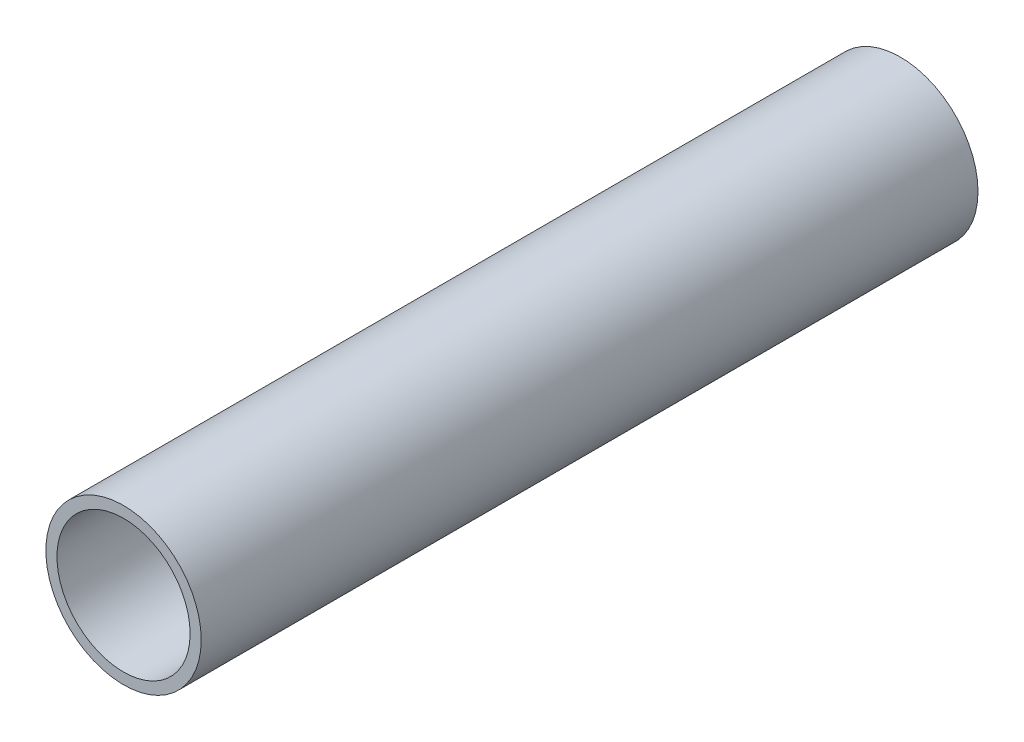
ISO-10303-21;
HEADER;
FILE_DESCRIPTION(('STEP AP214'),'2;1');
FILE_NAME('part.step','',(''),(''),'','','');
FILE_SCHEMA(('AUTOMOTIVE_DESIGN { 1 0 10303 214 1 1 1 1 }'));
ENDSEC;
DATA;
#1=APPLICATION_CONTEXT('core data for automotive mechanical design processes');
#2=APPLICATION_PROTOCOL_DEFINITION('international standard','automotive_design',2000,#1);
#3=PRODUCT_CONTEXT('',#1,'mechanical');
#4=PRODUCT('Part','Part','',(#3));
#5=PRODUCT_RELATED_PRODUCT_CATEGORY('part','',(#4));
#6=PRODUCT_DEFINITION_FORMATION('','',#4);
#7=PRODUCT_DEFINITION_CONTEXT('part definition',#1,'design');
#8=PRODUCT_DEFINITION('design','',#6,#7);
#9=PRODUCT_DEFINITION_SHAPE('','',#8);
#10=(LENGTH_UNIT() NAMED_UNIT(*) SI_UNIT(.MILLI.,.METRE.));
#11=(NAMED_UNIT(*) PLANE_ANGLE_UNIT() SI_UNIT($,.RADIAN.));
#12=(NAMED_UNIT(*) SI_UNIT($,.STERADIAN.) SOLID_ANGLE_UNIT());
#13=UNCERTAINTY_MEASURE_WITH_UNIT(LENGTH_MEASURE(1.E-05),#10,'distance_accuracy_value','');
#14=(GEOMETRIC_REPRESENTATION_CONTEXT(3) GLOBAL_UNCERTAINTY_ASSIGNED_CONTEXT((#13)) GLOBAL_UNIT_ASSIGNED_CONTEXT((#10,
#11,#12)) REPRESENTATION_CONTEXT('',''));
#15=CARTESIAN_POINT('',(0.,0.,0.));
#16=DIRECTION('',(0.,0.,1.));
#17=DIRECTION('',(1.,0.,0.));
#18=AXIS2_PLACEMENT_3D('',#15,#16,#17);
#19=CARTESIAN_POINT('',(0.,0.,35.));
#20=DIRECTION('',(0.,0.,1.));
#21=DIRECTION('',(1.,0.,0.));
#22=AXIS2_PLACEMENT_3D('',#19,#20,#21);
#23=PLANE('',#22);
#24=CARTESIAN_POINT('',(0.,0.,35.));
#25=DIRECTION('',(0.,0.,1.));
#26=DIRECTION('',(1.,0.,0.));
#27=AXIS2_PLACEMENT_3D('',#24,#25,#26);
#28=CIRCLE('',#27,3.5);
#29=CARTESIAN_POINT('',(3.5,0.,35.));
#30=VERTEX_POINT('',#29);
#31=EDGE_CURVE('E10',#30,#30,#28,.T.);
#32=ORIENTED_EDGE('',*,*,#31,.T.);
#33=EDGE_LOOP('',(#32));
#34=FACE_BOUND('',#33,.T.);
#35=CARTESIAN_POINT('',(0.,0.,35.));
#36=DIRECTION('',(0.,0.,1.));
#37=DIRECTION('',(1.,0.,0.));
#38=AXIS2_PLACEMENT_3D('',#35,#36,#37);
#39=CIRCLE('',#38,3.);
#40=CARTESIAN_POINT('',(3.,0.,35.));
#41=VERTEX_POINT('',#40);
#42=EDGE_CURVE('E38',#41,#41,#39,.T.);
#43=ORIENTED_EDGE('',*,*,#42,.F.);
#44=EDGE_LOOP('',(#43));
#45=FACE_BOUND('',#44,.T.);
#46=ADVANCED_FACE('F27',(#34,#45),#23,.T.);
#47=CARTESIAN_POINT('',(0.,0.,0.));
#48=DIRECTION('',(0.,0.,1.));
#49=DIRECTION('',(1.,0.,0.));
#50=AXIS2_PLACEMENT_3D('',#47,#48,#49);
#51=PLANE('',#50);
#52=CARTESIAN_POINT('',(0.,0.,0.));
#53=DIRECTION('',(0.,0.,1.));
#54=DIRECTION('',(1.,0.,0.));
#55=AXIS2_PLACEMENT_3D('',#52,#53,#54);
#56=CIRCLE('',#55,3.5);
#57=CARTESIAN_POINT('',(3.5,0.,0.));
#58=VERTEX_POINT('',#57);
#59=EDGE_CURVE('E34',#58,#58,#56,.T.);
#60=ORIENTED_EDGE('',*,*,#59,.F.);
#61=EDGE_LOOP('',(#60));
#62=FACE_BOUND('',#61,.T.);
#63=CARTESIAN_POINT('',(0.,0.,0.));
#64=DIRECTION('',(0.,0.,1.));
#65=DIRECTION('',(1.,0.,0.));
#66=AXIS2_PLACEMENT_3D('',#63,#64,#65);
#67=CIRCLE('',#66,3.);
#68=CARTESIAN_POINT('',(3.,0.,0.));
#69=VERTEX_POINT('',#68);
#70=EDGE_CURVE('E42',#69,#69,#67,.T.);
#71=ORIENTED_EDGE('',*,*,#70,.T.);
#72=EDGE_LOOP('',(#71));
#73=FACE_BOUND('',#72,.T.);
#74=ADVANCED_FACE('F48',(#62,#73),#51,.F.);
#75=CARTESIAN_POINT('',(0.,0.,35.));
#76=DIRECTION('',(0.,0.,-1.));
#77=DIRECTION('',(-1.,0.,0.));
#78=AXIS2_PLACEMENT_3D('',#75,#76,#77);
#79=CYLINDRICAL_SURFACE('',#78,3.5);
#80=ORIENTED_EDGE('',*,*,#31,.F.);
#81=EDGE_LOOP('',(#80));
#82=FACE_BOUND('',#81,.T.);
#83=ORIENTED_EDGE('',*,*,#59,.T.);
#84=EDGE_LOOP('',(#83));
#85=FACE_BOUND('',#84,.T.);
#86=ADVANCED_FACE('F29',(#82,#85),#79,.T.);
#87=CARTESIAN_POINT('',(0.,0.,35.));
#88=DIRECTION('',(0.,0.,-1.));
#89=DIRECTION('',(-1.,0.,0.));
#90=AXIS2_PLACEMENT_3D('',#87,#88,#89);
#91=CYLINDRICAL_SURFACE('',#90,3.);
#92=ORIENTED_EDGE('',*,*,#42,.T.);
#93=EDGE_LOOP('',(#92));
#94=FACE_BOUND('',#93,.T.);
#95=ORIENTED_EDGE('',*,*,#70,.F.);
#96=EDGE_LOOP('',(#95));
#97=FACE_BOUND('',#96,.T.);
#98=ADVANCED_FACE('F50',(#94,#97),#91,.F.);
#99=CLOSED_SHELL('',(#46,#74,#86,#98));
#100=MANIFOLD_SOLID_BREP('B2',#99);
#101=ADVANCED_BREP_SHAPE_REPRESENTATION('',(#18,#100),#14);
#102=SHAPE_DEFINITION_REPRESENTATION(#9,#101);
ENDSEC;
END-ISO-10303-21;
